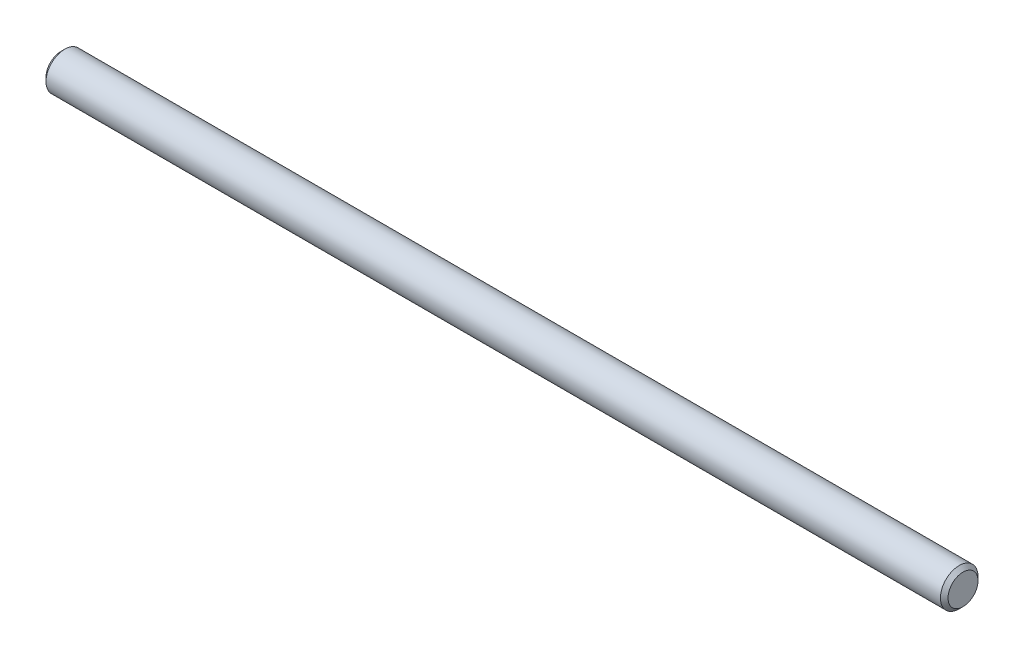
ISO-10303-21;
HEADER;
FILE_DESCRIPTION(('STEP AP214'),'2;1');
FILE_NAME('part.step','',(''),(''),'','','');
FILE_SCHEMA(('AUTOMOTIVE_DESIGN { 1 0 10303 214 1 1 1 1 }'));
ENDSEC;
DATA;
#1=APPLICATION_CONTEXT('core data for automotive mechanical design processes');
#2=APPLICATION_PROTOCOL_DEFINITION('international standard','automotive_design',2000,#1);
#3=PRODUCT_CONTEXT('',#1,'mechanical');
#4=PRODUCT('Part','Part','',(#3));
#5=PRODUCT_RELATED_PRODUCT_CATEGORY('part','',(#4));
#6=PRODUCT_DEFINITION_FORMATION('','',#4);
#7=PRODUCT_DEFINITION_CONTEXT('part definition',#1,'design');
#8=PRODUCT_DEFINITION('design','',#6,#7);
#9=PRODUCT_DEFINITION_SHAPE('','',#8);
#10=(LENGTH_UNIT() NAMED_UNIT(*) SI_UNIT(.MILLI.,.METRE.));
#11=(NAMED_UNIT(*) PLANE_ANGLE_UNIT() SI_UNIT($,.RADIAN.));
#12=(NAMED_UNIT(*) SI_UNIT($,.STERADIAN.) SOLID_ANGLE_UNIT());
#13=UNCERTAINTY_MEASURE_WITH_UNIT(LENGTH_MEASURE(1.E-05),#10,'distance_accuracy_value','');
#14=(GEOMETRIC_REPRESENTATION_CONTEXT(3) GLOBAL_UNCERTAINTY_ASSIGNED_CONTEXT((#13)) GLOBAL_UNIT_ASSIGNED_CONTEXT((#10,
#11,#12)) REPRESENTATION_CONTEXT('',''));
#15=CARTESIAN_POINT('',(0.,0.,0.));
#16=DIRECTION('',(0.,0.,1.));
#17=DIRECTION('',(1.,0.,0.));
#18=AXIS2_PLACEMENT_3D('',#15,#16,#17);
#19=CARTESIAN_POINT('',(96.,0.,0.));
#20=DIRECTION('',(-1.,0.,0.));
#21=DIRECTION('',(0.,0.,1.));
#22=AXIS2_PLACEMENT_3D('',#19,#20,#21);
#23=CYLINDRICAL_SURFACE('',#22,4.);
#24=CARTESIAN_POINT('',(95.19,0.,0.));
#25=DIRECTION('',(1.,0.,0.));
#26=DIRECTION('',(0.,0.,-1.));
#27=AXIS2_PLACEMENT_3D('',#24,#25,#26);
#28=CIRCLE('',#27,4.);
#29=CARTESIAN_POINT('',(95.19,0.,4.));
#30=VERTEX_POINT('',#29);
#31=EDGE_CURVE('E39',#30,#30,#28,.F.);
#32=CARTESIAN_POINT('',(-95.19,0.,0.));
#33=DIRECTION('',(1.,0.,0.));
#34=DIRECTION('',(0.,0.,-1.));
#35=AXIS2_PLACEMENT_3D('',#32,#33,#34);
#36=CIRCLE('',#35,4.);
#37=CARTESIAN_POINT('',(-95.19,0.,4.));
#38=VERTEX_POINT('',#37);
#39=EDGE_CURVE('E43',#38,#38,#36,.T.);
#40=CARTESIAN_POINT('',(95.19,0.,4.));
#41=CARTESIAN_POINT('',(93.206875,0.,4.));
#42=CARTESIAN_POINT('',(91.22375,0.,4.));
#43=CARTESIAN_POINT('',(87.2575,0.,4.));
#44=CARTESIAN_POINT('',(85.274375,0.,4.));
#45=CARTESIAN_POINT('',(81.308125,0.,4.));
#46=CARTESIAN_POINT('',(79.325,0.,4.));
#47=CARTESIAN_POINT('',(75.35875,0.,4.));
#48=CARTESIAN_POINT('',(73.375625,0.,4.));
#49=CARTESIAN_POINT('',(69.409375,0.,4.));
#50=CARTESIAN_POINT('',(67.42625,0.,4.));
#51=CARTESIAN_POINT('',(63.46,0.,4.));
#52=CARTESIAN_POINT('',(61.476875,0.,4.));
#53=CARTESIAN_POINT('',(57.510625,0.,4.));
#54=CARTESIAN_POINT('',(55.5275,0.,4.));
#55=CARTESIAN_POINT('',(51.56125,0.,4.));
#56=CARTESIAN_POINT('',(49.578125,0.,4.));
#57=CARTESIAN_POINT('',(45.611875,0.,4.));
#58=CARTESIAN_POINT('',(43.62875,0.,4.));
#59=CARTESIAN_POINT('',(39.6625,0.,4.));
#60=CARTESIAN_POINT('',(37.679375,0.,4.));
#61=CARTESIAN_POINT('',(33.713125,0.,4.));
#62=CARTESIAN_POINT('',(31.73,0.,4.));
#63=CARTESIAN_POINT('',(27.76375,0.,4.));
#64=CARTESIAN_POINT('',(25.780625,0.,4.));
#65=CARTESIAN_POINT('',(21.814375,0.,4.));
#66=CARTESIAN_POINT('',(19.83125,0.,4.));
#67=CARTESIAN_POINT('',(15.865,0.,4.));
#68=CARTESIAN_POINT('',(13.881875,0.,4.));
#69=CARTESIAN_POINT('',(9.91562499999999,0.,4.));
#70=CARTESIAN_POINT('',(7.9325,0.,4.));
#71=CARTESIAN_POINT('',(3.96625,0.,4.));
#72=CARTESIAN_POINT('',(1.983125,0.,4.));
#73=CARTESIAN_POINT('',(-1.983125,0.,4.));
#74=CARTESIAN_POINT('',(-3.96625,0.,4.));
#75=CARTESIAN_POINT('',(-7.93250000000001,0.,4.));
#76=CARTESIAN_POINT('',(-9.91562500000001,0.,4.));
#77=CARTESIAN_POINT('',(-13.881875,0.,4.));
#78=CARTESIAN_POINT('',(-15.865,0.,4.));
#79=CARTESIAN_POINT('',(-19.83125,0.,4.));
#80=CARTESIAN_POINT('',(-21.814375,0.,4.));
#81=CARTESIAN_POINT('',(-25.780625,0.,4.));
#82=CARTESIAN_POINT('',(-27.76375,0.,4.));
#83=CARTESIAN_POINT('',(-31.73,0.,4.));
#84=CARTESIAN_POINT('',(-33.713125,0.,4.));
#85=CARTESIAN_POINT('',(-37.679375,0.,4.));
#86=CARTESIAN_POINT('',(-39.6625,0.,4.));
#87=CARTESIAN_POINT('',(-43.62875,0.,4.));
#88=CARTESIAN_POINT('',(-45.611875,0.,4.));
#89=CARTESIAN_POINT('',(-49.578125,0.,4.));
#90=CARTESIAN_POINT('',(-51.56125,0.,4.));
#91=CARTESIAN_POINT('',(-55.5275,0.,4.));
#92=CARTESIAN_POINT('',(-57.510625,0.,4.));
#93=CARTESIAN_POINT('',(-61.476875,0.,4.));
#94=CARTESIAN_POINT('',(-63.46,0.,4.));
#95=CARTESIAN_POINT('',(-67.42625,0.,4.));
#96=CARTESIAN_POINT('',(-69.409375,0.,4.));
#97=CARTESIAN_POINT('',(-73.375625,0.,4.));
#98=CARTESIAN_POINT('',(-75.35875,0.,4.));
#99=CARTESIAN_POINT('',(-79.325,0.,4.));
#100=CARTESIAN_POINT('',(-81.308125,0.,4.));
#101=CARTESIAN_POINT('',(-85.274375,0.,4.));
#102=CARTESIAN_POINT('',(-87.2575,0.,4.));
#103=CARTESIAN_POINT('',(-91.22375,0.,4.));
#104=CARTESIAN_POINT('',(-93.206875,0.,4.));
#105=CARTESIAN_POINT('',(-95.19,0.,4.));
#106=B_SPLINE_CURVE_WITH_KNOTS('',3,(#40,#41,#42,#43,#44,#45,#46,#47,#48,#49,#50,#51,#52,#53,
#54,#55,#56,#57,#58,#59,#60,#61,#62,#63,#64,#65,#66,#67,#68,#69,#70,#71,#72,#73,#74,#75,#76,#77,
#78,#79,#80,#81,#82,#83,#84,#85,#86,#87,#88,#89,#90,#91,#92,#93,#94,#95,#96,#97,#98,#99,#100,
#101,#102,#103,#104,#105),.UNSPECIFIED.,.F.,.F.,(4,2,2,2,2,2,2,2,2,2,2,2,2,2,2,2,2,2,2,2,2,2,2,
2,2,2,2,2,2,2,2,2,4),(0.,5.94937499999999,11.89875,17.848125,23.7975,29.746875,35.69625,
41.645625,47.595,53.544375,59.49375,65.443125,71.3925,77.341875,83.29125,89.240625,95.19,
101.139375,107.08875,113.038125,118.9875,124.936875,130.88625,136.835625,142.785,148.734375,
154.68375,160.633125,166.5825,172.531875,178.48125,184.430625,190.38),.UNSPECIFIED.);
#107=EDGE_CURVE('BSEAM32',#30,#38,#106,.T.);
#108=ORIENTED_EDGE('',*,*,#31,.T.);
#109=ORIENTED_EDGE('',*,*,#39,.T.);
#110=ORIENTED_EDGE('',*,*,#107,.T.);
#111=ORIENTED_EDGE('',*,*,#107,.F.);
#112=EDGE_LOOP('',(#108,#110,#109,#111));
#113=FACE_BOUND('',#112,.T.);
#114=ADVANCED_FACE('F32',(#113),#23,.T.);
#115=CARTESIAN_POINT('',(96.,0.,0.));
#116=DIRECTION('',(1.,0.,0.));
#117=DIRECTION('',(0.,0.,-1.));
#118=AXIS2_PLACEMENT_3D('',#115,#116,#117);
#119=PLANE('',#118);
#120=CARTESIAN_POINT('',(96.,0.,0.));
#121=DIRECTION('',(1.,0.,0.));
#122=DIRECTION('',(0.,0.,-1.));
#123=AXIS2_PLACEMENT_3D('',#120,#121,#122);
#124=CIRCLE('',#123,3.19);
#125=CARTESIAN_POINT('',(96.,0.,3.19000000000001));
#126=VERTEX_POINT('',#125);
#127=EDGE_CURVE('E47',#126,#126,#124,.T.);
#128=ORIENTED_EDGE('',*,*,#127,.T.);
#129=EDGE_LOOP('',(#128));
#130=FACE_BOUND('',#129,.T.);
#131=ADVANCED_FACE('F53',(#130),#119,.T.);
#132=CARTESIAN_POINT('',(-96.,0.,0.));
#133=DIRECTION('',(1.,0.,0.));
#134=DIRECTION('',(0.,0.,-1.));
#135=AXIS2_PLACEMENT_3D('',#132,#133,#134);
#136=PLANE('',#135);
#137=CARTESIAN_POINT('',(-96.,0.,0.));
#138=DIRECTION('',(1.,0.,0.));
#139=DIRECTION('',(0.,0.,-1.));
#140=AXIS2_PLACEMENT_3D('',#137,#138,#139);
#141=CIRCLE('',#140,3.19);
#142=CARTESIAN_POINT('',(-96.,0.,-3.19));
#143=VERTEX_POINT('',#142);
#144=EDGE_CURVE('E10',#143,#143,#141,.F.);
#145=ORIENTED_EDGE('',*,*,#144,.T.);
#146=EDGE_LOOP('',(#145));
#147=FACE_BOUND('',#146,.T.);
#148=ADVANCED_FACE('F57',(#147),#136,.F.);
#149=CARTESIAN_POINT('',(96.,0.,0.));
#150=DIRECTION('',(-1.,0.,0.));
#151=DIRECTION('',(0.,0.,1.));
#152=AXIS2_PLACEMENT_3D('',#149,#150,#151);
#153=CONICAL_SURFACE('',#152,3.19,0.785398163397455);
#154=CARTESIAN_POINT('',(95.19,0.,4.00000000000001));
#155=CARTESIAN_POINT('',(95.1984375,0.,3.99156250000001));
#156=CARTESIAN_POINT('',(95.206875,0.,3.98312500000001));
#157=CARTESIAN_POINT('',(95.22375,0.,3.96625000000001));
#158=CARTESIAN_POINT('',(95.2321875,0.,3.95781250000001));
#159=CARTESIAN_POINT('',(95.2490625,0.,3.94093750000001));
#160=CARTESIAN_POINT('',(95.2575,0.,3.93250000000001));
#161=CARTESIAN_POINT('',(95.274375,0.,3.91562500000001));
#162=CARTESIAN_POINT('',(95.2828125,0.,3.90718750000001));
#163=CARTESIAN_POINT('',(95.2996875,0.,3.89031250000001));
#164=CARTESIAN_POINT('',(95.308125,0.,3.88187500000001));
#165=CARTESIAN_POINT('',(95.325,0.,3.86500000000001));
#166=CARTESIAN_POINT('',(95.3334375,0.,3.85656250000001));
#167=CARTESIAN_POINT('',(95.3503125,0.,3.83968750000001));
#168=CARTESIAN_POINT('',(95.35875,0.,3.83125000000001));
#169=CARTESIAN_POINT('',(95.375625,0.,3.81437500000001));
#170=CARTESIAN_POINT('',(95.3840625,0.,3.80593750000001));
#171=CARTESIAN_POINT('',(95.4009375,0.,3.78906250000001));
#172=CARTESIAN_POINT('',(95.409375,0.,3.78062500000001));
#173=CARTESIAN_POINT('',(95.42625,0.,3.76375000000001));
#174=CARTESIAN_POINT('',(95.4346875,0.,3.75531250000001));
#175=CARTESIAN_POINT('',(95.4515625,0.,3.73843750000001));
#176=CARTESIAN_POINT('',(95.46,0.,3.73000000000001));
#177=CARTESIAN_POINT('',(95.476875,0.,3.71312500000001));
#178=CARTESIAN_POINT('',(95.4853125,0.,3.70468750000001));
#179=CARTESIAN_POINT('',(95.5021875,0.,3.68781250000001));
#180=CARTESIAN_POINT('',(95.510625,0.,3.67937500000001));
#181=CARTESIAN_POINT('',(95.5275,0.,3.66250000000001));
#182=CARTESIAN_POINT('',(95.5359375,0.,3.65406250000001));
#183=CARTESIAN_POINT('',(95.5528125,0.,3.63718750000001));
#184=CARTESIAN_POINT('',(95.56125,0.,3.62875000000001));
#185=CARTESIAN_POINT('',(95.578125,0.,3.61187500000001));
#186=CARTESIAN_POINT('',(95.5865625,0.,3.60343750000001));
#187=CARTESIAN_POINT('',(95.6034375,0.,3.58656250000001));
#188=CARTESIAN_POINT('',(95.611875,0.,3.57812500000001));
#189=CARTESIAN_POINT('',(95.62875,0.,3.56125000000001));
#190=CARTESIAN_POINT('',(95.6371875,0.,3.55281250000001));
#191=CARTESIAN_POINT('',(95.6540625,0.,3.53593750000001));
#192=CARTESIAN_POINT('',(95.6625,0.,3.52750000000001));
#193=CARTESIAN_POINT('',(95.679375,0.,3.51062500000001));
#194=CARTESIAN_POINT('',(95.6878125,0.,3.50218750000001));
#195=CARTESIAN_POINT('',(95.7046875,0.,3.48531250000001));
#196=CARTESIAN_POINT('',(95.713125,0.,3.47687500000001));
#197=CARTESIAN_POINT('',(95.73,0.,3.46000000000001));
#198=CARTESIAN_POINT('',(95.7384375,0.,3.45156250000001));
#199=CARTESIAN_POINT('',(95.7553125,0.,3.43468750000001));
#200=CARTESIAN_POINT('',(95.76375,0.,3.42625000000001));
#201=CARTESIAN_POINT('',(95.780625,0.,3.40937500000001));
#202=CARTESIAN_POINT('',(95.7890625,0.,3.40093750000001));
#203=CARTESIAN_POINT('',(95.8059375,0.,3.38406250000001));
#204=CARTESIAN_POINT('',(95.814375,0.,3.37562500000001));
#205=CARTESIAN_POINT('',(95.83125,0.,3.35875000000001));
#206=CARTESIAN_POINT('',(95.8396875,0.,3.35031250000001));
#207=CARTESIAN_POINT('',(95.8565625,0.,3.33343750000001));
#208=CARTESIAN_POINT('',(95.865,0.,3.32500000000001));
#209=CARTESIAN_POINT('',(95.881875,0.,3.30812500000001));
#210=CARTESIAN_POINT('',(95.8903125,0.,3.29968750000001));
#211=CARTESIAN_POINT('',(95.9071875,0.,3.28281250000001));
#212=CARTESIAN_POINT('',(95.915625,0.,3.27437500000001));
#213=CARTESIAN_POINT('',(95.9325,0.,3.25750000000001));
#214=CARTESIAN_POINT('',(95.9409375,0.,3.24906250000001));
#215=CARTESIAN_POINT('',(95.9578125,0.,3.23218750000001));
#216=CARTESIAN_POINT('',(95.96625,0.,3.22375));
#217=CARTESIAN_POINT('',(95.983125,0.,3.206875));
#218=CARTESIAN_POINT('',(95.9915625,0.,3.1984375));
#219=CARTESIAN_POINT('',(96.,0.,3.19000000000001));
#220=B_SPLINE_CURVE_WITH_KNOTS('',3,(#154,#155,#156,#157,#158,#159,#160,#161,#162,#163,#164,
#165,#166,#167,#168,#169,#170,#171,#172,#173,#174,#175,#176,#177,#178,#179,#180,#181,#182,#183,
#184,#185,#186,#187,#188,#189,#190,#191,#192,#193,#194,#195,#196,#197,#198,#199,#200,#201,#202,
#203,#204,#205,#206,#207,#208,#209,#210,#211,#212,#213,#214,#215,#216,#217,#218,#219),
.UNSPECIFIED.,.F.,.F.,(4,2,2,2,2,2,2,2,2,2,2,2,2,2,2,2,2,2,2,2,2,2,2,2,2,2,2,2,2,2,2,2,4),(0.,
0.0357972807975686,0.0715945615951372,0.107391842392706,0.143189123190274,0.178986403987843,
0.214783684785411,0.250580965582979,0.286378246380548,0.322175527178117,0.357972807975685,
0.393770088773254,0.429567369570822,0.465364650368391,0.501161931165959,0.536959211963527,
0.572756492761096,0.608553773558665,0.644351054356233,0.680148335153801,0.71594561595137,
0.751742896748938,0.787540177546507,0.823337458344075,0.859134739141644,0.894932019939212,
0.930729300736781,0.966526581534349,1.00232386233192,1.03812114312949,1.07391842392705,
1.10971570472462,1.1455129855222),.UNSPECIFIED.);
#221=EDGE_CURVE('BSEAM55',#30,#126,#220,.T.);
#222=ORIENTED_EDGE('',*,*,#31,.F.);
#223=ORIENTED_EDGE('',*,*,#127,.F.);
#224=ORIENTED_EDGE('',*,*,#221,.T.);
#225=ORIENTED_EDGE('',*,*,#221,.F.);
#226=EDGE_LOOP('',(#222,#224,#223,#225));
#227=FACE_BOUND('',#226,.T.);
#228=ADVANCED_FACE('F55',(#227),#153,.T.);
#229=CARTESIAN_POINT('',(-95.19,0.,0.));
#230=DIRECTION('',(1.,0.,0.));
#231=DIRECTION('',(0.,0.,-1.));
#232=AXIS2_PLACEMENT_3D('',#229,#230,#231);
#233=CONICAL_SURFACE('',#232,4.,0.785398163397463);
#234=ORIENTED_EDGE('',*,*,#144,.F.);
#235=EDGE_LOOP('',(#234));
#236=FACE_BOUND('',#235,.T.);
#237=ORIENTED_EDGE('',*,*,#39,.F.);
#238=EDGE_LOOP('',(#237));
#239=FACE_BOUND('',#238,.T.);
#240=ADVANCED_FACE('F34',(#236,#239),#233,.T.);
#241=CLOSED_SHELL('',(#114,#131,#148,#228,#240));
#242=MANIFOLD_SOLID_BREP('B2',#241);
#243=ADVANCED_BREP_SHAPE_REPRESENTATION('',(#18,#242),#14);
#244=SHAPE_DEFINITION_REPRESENTATION(#9,#243);
ENDSEC;
END-ISO-10303-21;
